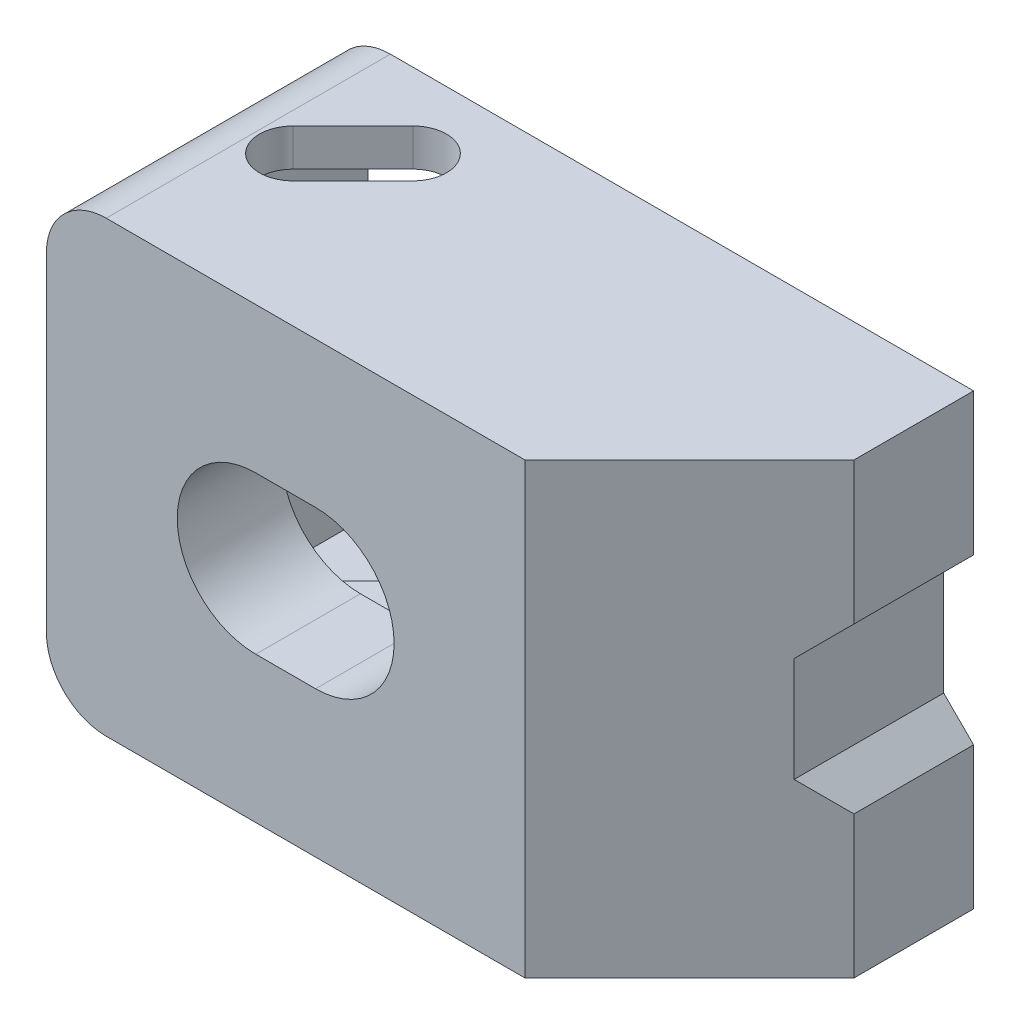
ISO-10303-21;
HEADER;
FILE_DESCRIPTION(('STEP AP214'),'2;1');
FILE_NAME('part.step','',(''),(''),'','','');
FILE_SCHEMA(('AUTOMOTIVE_DESIGN { 1 0 10303 214 1 1 1 1 }'));
ENDSEC;
DATA;
#1=APPLICATION_CONTEXT('core data for automotive mechanical design processes');
#2=APPLICATION_PROTOCOL_DEFINITION('international standard','automotive_design',2000,#1);
#3=PRODUCT_CONTEXT('',#1,'mechanical');
#4=PRODUCT('Part','Part','',(#3));
#5=PRODUCT_RELATED_PRODUCT_CATEGORY('part','',(#4));
#6=PRODUCT_DEFINITION_FORMATION('','',#4);
#7=PRODUCT_DEFINITION_CONTEXT('part definition',#1,'design');
#8=PRODUCT_DEFINITION('design','',#6,#7);
#9=PRODUCT_DEFINITION_SHAPE('','',#8);
#10=(LENGTH_UNIT() NAMED_UNIT(*) SI_UNIT(.MILLI.,.METRE.));
#11=(NAMED_UNIT(*) PLANE_ANGLE_UNIT() SI_UNIT($,.RADIAN.));
#12=(NAMED_UNIT(*) SI_UNIT($,.STERADIAN.) SOLID_ANGLE_UNIT());
#13=UNCERTAINTY_MEASURE_WITH_UNIT(LENGTH_MEASURE(1.E-05),#10,'distance_accuracy_value','');
#14=(GEOMETRIC_REPRESENTATION_CONTEXT(3) GLOBAL_UNCERTAINTY_ASSIGNED_CONTEXT((#13)) GLOBAL_UNIT_ASSIGNED_CONTEXT((#10,
#11,#12)) REPRESENTATION_CONTEXT('',''));
#15=CARTESIAN_POINT('',(0.,0.,0.));
#16=DIRECTION('',(0.,0.,1.));
#17=DIRECTION('',(1.,0.,0.));
#18=AXIS2_PLACEMENT_3D('',#15,#16,#17);
#19=CARTESIAN_POINT('',(25.,-34.2353840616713,0.));
#20=DIRECTION('',(1.,0.,0.));
#21=DIRECTION('',(0.,1.,0.));
#22=AXIS2_PLACEMENT_3D('',#19,#20,#21);
#23=PLANE('',#22);
#24=DIRECTION('',(0.,0.,1.));
#25=VECTOR('',#24,1.);
#26=CARTESIAN_POINT('',(25.,5.5,-4.99999999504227E-05));
#27=LINE('',#26,#25);
#28=CARTESIAN_POINT('',(25.,5.5,0.));
#29=VERTEX_POINT('',#28);
#30=CARTESIAN_POINT('',(25.,5.5,8.));
#31=VERTEX_POINT('',#30);
#32=EDGE_CURVE('E467',#29,#31,#27,.T.);
#33=ORIENTED_EDGE('',*,*,#32,.F.);
#34=DIRECTION('',(0.,1.,0.));
#35=VECTOR('',#34,1.);
#36=CARTESIAN_POINT('',(25.,-34.2353840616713,0.));
#37=LINE('',#36,#35);
#38=CARTESIAN_POINT('',(25.,15.,0.));
#39=VERTEX_POINT('',#38);
#40=EDGE_CURVE('E308',#29,#39,#37,.T.);
#41=ORIENTED_EDGE('',*,*,#40,.T.);
#42=DIRECTION('',(0.,0.,-1.));
#43=VECTOR('',#42,1.);
#44=CARTESIAN_POINT('',(25.,15.,0.));
#45=LINE('',#44,#43);
#46=CARTESIAN_POINT('',(25.,15.,8.));
#47=VERTEX_POINT('',#46);
#48=EDGE_CURVE('E297',#47,#39,#45,.T.);
#49=ORIENTED_EDGE('',*,*,#48,.F.);
#50=DIRECTION('',(0.,1.,0.));
#51=VECTOR('',#50,1.);
#52=CARTESIAN_POINT('',(25.,-15.,8.));
#53=LINE('',#52,#51);
#54=EDGE_CURVE('E293',#31,#47,#53,.T.);
#55=ORIENTED_EDGE('',*,*,#54,.F.);
#56=EDGE_LOOP('',(#33,#41,#49,#55));
#57=FACE_BOUND('',#56,.T.);
#58=ADVANCED_FACE('F14',(#57),#23,.T.);
#59=CARTESIAN_POINT('',(22.,-15.,32.));
#60=DIRECTION('',(0.,1.,0.));
#61=DIRECTION('',(-1.,0.,0.));
#62=AXIS2_PLACEMENT_3D('',#59,#60,#61);
#63=PLANE('',#62);
#64=DIRECTION('',(1.,0.,0.));
#65=VECTOR('',#64,1.);
#66=CARTESIAN_POINT('',(-7.,-15.,19.));
#67=LINE('',#66,#65);
#68=CARTESIAN_POINT('',(-14.,-15.,19.));
#69=VERTEX_POINT('',#68);
#70=CARTESIAN_POINT('',(14.,-15.,19.));
#71=VERTEX_POINT('',#70);
#72=EDGE_CURVE('E391',#69,#71,#67,.T.);
#73=ORIENTED_EDGE('',*,*,#72,.F.);
#74=DIRECTION('',(0.,0.,1.));
#75=VECTOR('',#74,1.);
#76=CARTESIAN_POINT('',(-14.,-15.,32.));
#77=LINE('',#76,#75);
#78=CARTESIAN_POINT('',(-14.,-15.,0.));
#79=VERTEX_POINT('',#78);
#80=EDGE_CURVE('E37',#69,#79,#77,.F.);
#81=ORIENTED_EDGE('',*,*,#80,.T.);
#82=DIRECTION('',(1.,0.,0.));
#83=VECTOR('',#82,1.);
#84=CARTESIAN_POINT('',(22.,-15.,0.));
#85=LINE('',#84,#83);
#86=CARTESIAN_POINT('',(25.,-15.,0.));
#87=VERTEX_POINT('',#86);
#88=EDGE_CURVE('E447',#79,#87,#85,.T.);
#89=ORIENTED_EDGE('',*,*,#88,.T.);
#90=DIRECTION('',(0.,0.,1.));
#91=VECTOR('',#90,1.);
#92=CARTESIAN_POINT('',(25.,-15.,0.));
#93=LINE('',#92,#91);
#94=CARTESIAN_POINT('',(25.,-15.,8.));
#95=VERTEX_POINT('',#94);
#96=EDGE_CURVE('E301',#87,#95,#93,.T.);
#97=ORIENTED_EDGE('',*,*,#96,.T.);
#98=DIRECTION('',(-0.707106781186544,0.,0.707106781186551));
#99=VECTOR('',#98,1.);
#100=CARTESIAN_POINT('',(25.,-15.,8.));
#101=LINE('',#100,#99);
#102=EDGE_CURVE('E287',#95,#71,#101,.T.);
#103=ORIENTED_EDGE('',*,*,#102,.T.);
#104=EDGE_LOOP('',(#73,#81,#89,#97,#103));
#105=FACE_BOUND('',#104,.T.);
#106=CARTESIAN_POINT('',(-11.5,-15.,9.));
#107=DIRECTION('',(0.,1.,0.));
#108=DIRECTION('',(0.,0.,-1.));
#109=AXIS2_PLACEMENT_3D('',#106,#107,#108);
#110=CIRCLE('',#109,2.25);
#111=CARTESIAN_POINT('',(-13.0909902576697,-15.,7.4090097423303));
#112=VERTEX_POINT('',#111);
#113=CARTESIAN_POINT('',(-9.90900974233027,-15.,10.5909902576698));
#114=VERTEX_POINT('',#113);
#115=EDGE_CURVE('E323',#112,#114,#110,.T.);
#116=ORIENTED_EDGE('',*,*,#115,.T.);
#117=DIRECTION('',(0.707106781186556,0.,-0.70710678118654));
#118=VECTOR('',#117,1.);
#119=CARTESIAN_POINT('',(-9.90900974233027,-15.,10.5909902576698));
#120=LINE('',#119,#118);
#121=CARTESIAN_POINT('',(-5.90900974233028,-15.,6.59099025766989));
#122=VERTEX_POINT('',#121);
#123=EDGE_CURVE('E310',#114,#122,#120,.T.);
#124=ORIENTED_EDGE('',*,*,#123,.T.);
#125=CARTESIAN_POINT('',(-7.5,-15.,5.00000000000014));
#126=DIRECTION('',(0.,1.,0.));
#127=DIRECTION('',(0.,0.,-1.));
#128=AXIS2_PLACEMENT_3D('',#125,#126,#127);
#129=CIRCLE('',#128,2.25);
#130=CARTESIAN_POINT('',(-9.0909902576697,-15.,3.40900974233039));
#131=VERTEX_POINT('',#130);
#132=EDGE_CURVE('E315',#122,#131,#129,.T.);
#133=ORIENTED_EDGE('',*,*,#132,.T.);
#134=DIRECTION('',(-0.707106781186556,0.,0.707106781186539));
#135=VECTOR('',#134,1.);
#136=CARTESIAN_POINT('',(-13.0909902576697,-15.,7.4090097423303));
#137=LINE('',#136,#135);
#138=EDGE_CURVE('E319',#131,#112,#137,.T.);
#139=ORIENTED_EDGE('',*,*,#138,.T.);
#140=EDGE_LOOP('',(#116,#124,#133,#139));
#141=FACE_BOUND('',#140,.T.);
#142=ADVANCED_FACE('F459',(#105,#141),#63,.F.);
#143=CARTESIAN_POINT('',(-15.5,-12.5,0.));
#144=DIRECTION('',(0.,1.,0.));
#145=DIRECTION('',(0.,0.,-1.));
#146=AXIS2_PLACEMENT_3D('',#143,#144,#145);
#147=PLANE('',#146);
#148=DIRECTION('',(-1.,0.,0.));
#149=VECTOR('',#148,1.);
#150=CARTESIAN_POINT('',(-15.5,-12.5,0.));
#151=LINE('',#150,#149);
#152=CARTESIAN_POINT('',(19.4705627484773,-12.5,0.));
#153=VERTEX_POINT('',#152);
#154=CARTESIAN_POINT('',(-15.5,-12.5,0.));
#155=VERTEX_POINT('',#154);
#156=EDGE_CURVE('E502',#153,#155,#151,.T.);
#157=ORIENTED_EDGE('',*,*,#156,.T.);
#158=DIRECTION('',(0.,0.,1.));
#159=VECTOR('',#158,1.);
#160=CARTESIAN_POINT('',(-15.5,-12.5,14.));
#161=LINE('',#160,#159);
#162=CARTESIAN_POINT('',(-15.5,-12.5,14.));
#163=VERTEX_POINT('',#162);
#164=EDGE_CURVE('E498',#155,#163,#161,.T.);
#165=ORIENTED_EDGE('',*,*,#164,.T.);
#166=DIRECTION('',(1.,0.,0.));
#167=VECTOR('',#166,1.);
#168=CARTESIAN_POINT('',(-11.5,-12.5,14.));
#169=LINE('',#168,#167);
#170=CARTESIAN_POINT('',(-11.5,-12.5,14.));
#171=VERTEX_POINT('',#170);
#172=EDGE_CURVE('E501',#163,#171,#169,.T.);
#173=ORIENTED_EDGE('',*,*,#172,.T.);
#174=DIRECTION('',(0.707106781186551,0.,-0.707106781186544));
#175=VECTOR('',#174,1.);
#176=CARTESIAN_POINT('',(-4.5,-12.5,7.));
#177=LINE('',#176,#175);
#178=CARTESIAN_POINT('',(-4.5,-12.5,7.));
#179=VERTEX_POINT('',#178);
#180=EDGE_CURVE('E521',#171,#179,#177,.T.);
#181=ORIENTED_EDGE('',*,*,#180,.T.);
#182=DIRECTION('',(1.,0.,0.));
#183=VECTOR('',#182,1.);
#184=CARTESIAN_POINT('',(12.4705627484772,-12.5,7.));
#185=LINE('',#184,#183);
#186=CARTESIAN_POINT('',(12.4705627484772,-12.5,7.));
#187=VERTEX_POINT('',#186);
#188=EDGE_CURVE('E524',#179,#187,#185,.T.);
#189=ORIENTED_EDGE('',*,*,#188,.T.);
#190=DIRECTION('',(0.707106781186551,0.,-0.707106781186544));
#191=VECTOR('',#190,1.);
#192=CARTESIAN_POINT('',(19.4705627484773,-12.5,0.));
#193=LINE('',#192,#191);
#194=EDGE_CURVE('E527',#187,#153,#193,.T.);
#195=ORIENTED_EDGE('',*,*,#194,.T.);
#196=EDGE_LOOP('',(#157,#165,#173,#181,#189,#195));
#197=FACE_BOUND('',#196,.T.);
#198=DIRECTION('',(-0.707106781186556,0.,0.70710678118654));
#199=VECTOR('',#198,1.);
#200=CARTESIAN_POINT('',(-7.40900974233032,-12.5,8.0909902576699));
#201=LINE('',#200,#199);
#202=CARTESIAN_POINT('',(-5.90900974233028,-12.5,6.59099025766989));
#203=VERTEX_POINT('',#202);
#204=CARTESIAN_POINT('',(-9.90900974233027,-12.5,10.5909902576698));
#205=VERTEX_POINT('',#204);
#206=EDGE_CURVE('E336',#203,#205,#201,.T.);
#207=ORIENTED_EDGE('',*,*,#206,.T.);
#208=CARTESIAN_POINT('',(-11.5,-12.5,9.));
#209=DIRECTION('',(0.,1.,0.));
#210=DIRECTION('',(0.,0.,-1.));
#211=AXIS2_PLACEMENT_3D('',#208,#209,#210);
#212=CIRCLE('',#211,2.25);
#213=CARTESIAN_POINT('',(-13.0909902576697,-12.5,7.4090097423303));
#214=VERTEX_POINT('',#213);
#215=EDGE_CURVE('E339',#205,#214,#212,.F.);
#216=ORIENTED_EDGE('',*,*,#215,.T.);
#217=DIRECTION('',(0.707106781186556,0.,-0.707106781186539));
#218=VECTOR('',#217,1.);
#219=CARTESIAN_POINT('',(-10.5909902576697,-12.5,4.9090097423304));
#220=LINE('',#219,#218);
#221=CARTESIAN_POINT('',(-9.0909902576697,-12.5,3.40900974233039));
#222=VERTEX_POINT('',#221);
#223=EDGE_CURVE('E322',#214,#222,#220,.T.);
#224=ORIENTED_EDGE('',*,*,#223,.T.);
#225=CARTESIAN_POINT('',(-7.5,-12.5,5.00000000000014));
#226=DIRECTION('',(0.,1.,0.));
#227=DIRECTION('',(0.,0.,-1.));
#228=AXIS2_PLACEMENT_3D('',#225,#226,#227);
#229=CIRCLE('',#228,2.25);
#230=EDGE_CURVE('E333',#222,#203,#229,.F.);
#231=ORIENTED_EDGE('',*,*,#230,.T.);
#232=EDGE_LOOP('',(#207,#216,#224,#231));
#233=FACE_BOUND('',#232,.T.);
#234=ADVANCED_FACE('F631',(#197,#233),#147,.T.);
#235=CARTESIAN_POINT('',(0.,0.,12.));
#236=DIRECTION('',(0.,0.,-1.));
#237=DIRECTION('',(1.,0.,0.));
#238=AXIS2_PLACEMENT_3D('',#235,#236,#237);
#239=CYLINDRICAL_SURFACE('',#238,7.25);
#240=DIRECTION('',(0.,0.,-1.));
#241=VECTOR('',#240,1.);
#242=CARTESIAN_POINT('',(6.20483682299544,3.75,12.));
#243=LINE('',#242,#241);
#244=CARTESIAN_POINT('',(6.20483682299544,3.75,12.));
#245=VERTEX_POINT('',#244);
#246=CARTESIAN_POINT('',(6.20483682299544,3.75,7.));
#247=VERTEX_POINT('',#246);
#248=EDGE_CURVE('E389',#245,#247,#243,.T.);
#249=ORIENTED_EDGE('',*,*,#248,.F.);
#250=CARTESIAN_POINT('',(0.,0.,12.));
#251=DIRECTION('',(0.,0.,-1.));
#252=DIRECTION('',(1.,0.,0.));
#253=AXIS2_PLACEMENT_3D('',#250,#251,#252);
#254=CIRCLE('',#253,7.25);
#255=CARTESIAN_POINT('',(0.,7.25,12.));
#256=VERTEX_POINT('',#255);
#257=EDGE_CURVE('E558',#256,#245,#254,.T.);
#258=ORIENTED_EDGE('',*,*,#257,.F.);
#259=DIRECTION('',(0.,0.,-1.));
#260=VECTOR('',#259,1.);
#261=CARTESIAN_POINT('',(0.,7.25,12.));
#262=LINE('',#261,#260);
#263=CARTESIAN_POINT('',(0.,7.25,7.));
#264=VERTEX_POINT('',#263);
#265=EDGE_CURVE('E564',#256,#264,#262,.T.);
#266=ORIENTED_EDGE('',*,*,#265,.T.);
#267=CARTESIAN_POINT('',(0.,0.,7.));
#268=DIRECTION('',(0.,0.,1.));
#269=DIRECTION('',(-1.,0.,0.));
#270=AXIS2_PLACEMENT_3D('',#267,#268,#269);
#271=CIRCLE('',#270,7.25);
#272=EDGE_CURVE('E493',#264,#247,#271,.F.);
#273=ORIENTED_EDGE('',*,*,#272,.T.);
#274=EDGE_LOOP('',(#249,#258,#266,#273));
#275=FACE_BOUND('',#274,.T.);
#276=ADVANCED_FACE('F699',(#275),#239,.F.);
#277=DIRECTION('',(0.,0.,-1.));
#278=VECTOR('',#277,1.);
#279=CARTESIAN_POINT('',(6.20483682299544,-3.75,12.));
#280=LINE('',#279,#278);
#281=CARTESIAN_POINT('',(6.20483682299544,-3.75,7.));
#282=VERTEX_POINT('',#281);
#283=CARTESIAN_POINT('',(6.20483682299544,-3.75,12.));
#284=VERTEX_POINT('',#283);
#285=EDGE_CURVE('E387',#282,#284,#280,.F.);
#286=ORIENTED_EDGE('',*,*,#285,.F.);
#287=CARTESIAN_POINT('',(0.,-7.25,7.));
#288=VERTEX_POINT('',#287);
#289=EDGE_CURVE('E492',#282,#288,#271,.F.);
#290=ORIENTED_EDGE('',*,*,#289,.T.);
#291=DIRECTION('',(0.,0.,-1.));
#292=VECTOR('',#291,1.);
#293=CARTESIAN_POINT('',(0.,-7.25,12.));
#294=LINE('',#293,#292);
#295=CARTESIAN_POINT('',(0.,-7.25,12.));
#296=VERTEX_POINT('',#295);
#297=EDGE_CURVE('E565',#296,#288,#294,.T.);
#298=ORIENTED_EDGE('',*,*,#297,.F.);
#299=EDGE_CURVE('E557',#284,#296,#254,.T.);
#300=ORIENTED_EDGE('',*,*,#299,.F.);
#301=EDGE_LOOP('',(#286,#290,#298,#300));
#302=FACE_BOUND('',#301,.T.);
#303=ADVANCED_FACE('F706',(#302),#239,.F.);
#304=CARTESIAN_POINT('',(12.4705627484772,-12.5,7.));
#305=DIRECTION('',(0.,0.,1.));
#306=DIRECTION('',(-1.,0.,0.));
#307=AXIS2_PLACEMENT_3D('',#304,#305,#306);
#308=PLANE('',#307);
#309=CARTESIAN_POINT('',(12.,0.,7.));
#310=DIRECTION('',(0.,0.,1.));
#311=DIRECTION('',(-1.,0.,0.));
#312=AXIS2_PLACEMENT_3D('',#309,#310,#311);
#313=CIRCLE('',#312,3.75);
#314=CARTESIAN_POINT('',(12.,3.75,7.));
#315=VERTEX_POINT('',#314);
#316=CARTESIAN_POINT('',(12.4705627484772,3.72035894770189,7.));
#317=VERTEX_POINT('',#316);
#318=EDGE_CURVE('E386',#315,#317,#313,.F.);
#319=ORIENTED_EDGE('',*,*,#318,.F.);
#320=DIRECTION('',(1.,0.,0.));
#321=VECTOR('',#320,1.);
#322=CARTESIAN_POINT('',(12.4705627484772,3.75,7.));
#323=LINE('',#322,#321);
#324=EDGE_CURVE('E426',#247,#315,#323,.T.);
#325=ORIENTED_EDGE('',*,*,#324,.F.);
#326=ORIENTED_EDGE('',*,*,#272,.F.);
#327=DIRECTION('',(1.,0.,0.));
#328=VECTOR('',#327,1.);
#329=CARTESIAN_POINT('',(-15.5,7.25,7.));
#330=LINE('',#329,#328);
#331=CARTESIAN_POINT('',(-4.5,7.25,7.));
#332=VERTEX_POINT('',#331);
#333=EDGE_CURVE('E547',#332,#264,#330,.T.);
#334=ORIENTED_EDGE('',*,*,#333,.F.);
#335=DIRECTION('',(0.,1.,0.));
#336=VECTOR('',#335,1.);
#337=CARTESIAN_POINT('',(-4.5,-12.5,7.));
#338=LINE('',#337,#336);
#339=CARTESIAN_POINT('',(-4.5,12.5,7.));
#340=VERTEX_POINT('',#339);
#341=EDGE_CURVE('E540',#332,#340,#338,.T.);
#342=ORIENTED_EDGE('',*,*,#341,.T.);
#343=DIRECTION('',(1.,0.,0.));
#344=VECTOR('',#343,1.);
#345=CARTESIAN_POINT('',(12.4705627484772,12.5,7.));
#346=LINE('',#345,#344);
#347=CARTESIAN_POINT('',(12.4705627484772,12.5,7.));
#348=VERTEX_POINT('',#347);
#349=EDGE_CURVE('E510',#340,#348,#346,.T.);
#350=ORIENTED_EDGE('',*,*,#349,.T.);
#351=DIRECTION('',(0.,1.,0.));
#352=VECTOR('',#351,1.);
#353=CARTESIAN_POINT('',(12.4705627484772,-12.5,7.));
#354=LINE('',#353,#352);
#355=EDGE_CURVE('E536',#317,#348,#354,.T.);
#356=ORIENTED_EDGE('',*,*,#355,.F.);
#357=EDGE_LOOP('',(#319,#325,#326,#334,#342,#350,#356));
#358=FACE_BOUND('',#357,.T.);
#359=ADVANCED_FACE('F703',(#358),#308,.F.);
#360=CARTESIAN_POINT('',(12.4705627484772,-3.7203589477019,7.));
#361=VERTEX_POINT('',#360);
#362=CARTESIAN_POINT('',(12.,-3.75,7.));
#363=VERTEX_POINT('',#362);
#364=EDGE_CURVE('E384',#361,#363,#313,.F.);
#365=ORIENTED_EDGE('',*,*,#364,.F.);
#366=EDGE_CURVE('E533',#187,#361,#354,.T.);
#367=ORIENTED_EDGE('',*,*,#366,.F.);
#368=ORIENTED_EDGE('',*,*,#188,.F.);
#369=CARTESIAN_POINT('',(-4.5,-7.25,7.));
#370=VERTEX_POINT('',#369);
#371=EDGE_CURVE('E537',#179,#370,#338,.T.);
#372=ORIENTED_EDGE('',*,*,#371,.T.);
#373=DIRECTION('',(-1.,0.,0.));
#374=VECTOR('',#373,1.);
#375=CARTESIAN_POINT('',(-15.5,-7.25,7.));
#376=LINE('',#375,#374);
#377=EDGE_CURVE('E532',#288,#370,#376,.T.);
#378=ORIENTED_EDGE('',*,*,#377,.F.);
#379=ORIENTED_EDGE('',*,*,#289,.F.);
#380=DIRECTION('',(-1.,0.,0.));
#381=VECTOR('',#380,1.);
#382=CARTESIAN_POINT('',(12.4705627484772,-3.75,7.));
#383=LINE('',#382,#381);
#384=EDGE_CURVE('E423',#363,#282,#383,.T.);
#385=ORIENTED_EDGE('',*,*,#384,.F.);
#386=EDGE_LOOP('',(#365,#367,#368,#372,#378,#379,#385));
#387=FACE_BOUND('',#386,.T.);
#388=ADVANCED_FACE('F702',(#387),#308,.F.);
#389=CARTESIAN_POINT('',(19.4705627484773,-12.5,0.));
#390=DIRECTION('',(0.707106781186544,0.,0.707106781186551));
#391=DIRECTION('',(-0.707106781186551,0.,0.707106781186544));
#392=AXIS2_PLACEMENT_3D('',#389,#390,#391);
#393=PLANE('',#392);
#394=CARTESIAN_POINT('',(12.,0.,7.47056274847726));
#395=DIRECTION('',(0.707106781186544,0.,0.707106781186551));
#396=DIRECTION('',(0.707106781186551,0.,-0.707106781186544));
#397=AXIS2_PLACEMENT_3D('',#394,#395,#396);
#398=ELLIPSE('',#397,5.30330085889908,3.75);
#399=EDGE_CURVE('E421',#317,#361,#398,.F.);
#400=ORIENTED_EDGE('',*,*,#399,.F.);
#401=ORIENTED_EDGE('',*,*,#355,.T.);
#402=DIRECTION('',(0.707106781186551,0.,-0.707106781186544));
#403=VECTOR('',#402,1.);
#404=CARTESIAN_POINT('',(19.4705627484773,12.5,0.));
#405=LINE('',#404,#403);
#406=CARTESIAN_POINT('',(19.4705627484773,12.5,0.));
#407=VERTEX_POINT('',#406);
#408=EDGE_CURVE('E505',#348,#407,#405,.T.);
#409=ORIENTED_EDGE('',*,*,#408,.T.);
#410=DIRECTION('',(0.,1.,0.));
#411=VECTOR('',#410,1.);
#412=CARTESIAN_POINT('',(19.4705627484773,-12.5,0.));
#413=LINE('',#412,#411);
#414=EDGE_CURVE('E530',#153,#407,#413,.T.);
#415=ORIENTED_EDGE('',*,*,#414,.F.);
#416=ORIENTED_EDGE('',*,*,#194,.F.);
#417=ORIENTED_EDGE('',*,*,#366,.T.);
#418=EDGE_LOOP('',(#400,#401,#409,#415,#416,#417));
#419=FACE_BOUND('',#418,.T.);
#420=ADVANCED_FACE('F621',(#419),#393,.F.);
#421=CARTESIAN_POINT('',(22.,15.,0.));
#422=DIRECTION('',(0.,0.,1.));
#423=DIRECTION('',(-1.,0.,0.));
#424=AXIS2_PLACEMENT_3D('',#421,#422,#423);
#425=PLANE('',#424);
#426=ORIENTED_EDGE('',*,*,#88,.F.);
#427=CARTESIAN_POINT('',(-14.,-11.,0.));
#428=DIRECTION('',(0.,0.,1.));
#429=DIRECTION('',(-1.,0.,0.));
#430=AXIS2_PLACEMENT_3D('',#427,#428,#429);
#431=CIRCLE('',#430,4.);
#432=CARTESIAN_POINT('',(-18.,-11.,0.));
#433=VERTEX_POINT('',#432);
#434=EDGE_CURVE('E22',#79,#433,#431,.F.);
#435=ORIENTED_EDGE('',*,*,#434,.T.);
#436=DIRECTION('',(0.,-1.,0.));
#437=VECTOR('',#436,1.);
#438=CARTESIAN_POINT('',(-18.,15.,0.));
#439=LINE('',#438,#437);
#440=CARTESIAN_POINT('',(-18.,11.,0.));
#441=VERTEX_POINT('',#440);
#442=EDGE_CURVE('E402',#441,#433,#439,.T.);
#443=ORIENTED_EDGE('',*,*,#442,.F.);
#444=CARTESIAN_POINT('',(-14.,11.,0.));
#445=DIRECTION('',(0.,0.,1.));
#446=DIRECTION('',(-1.,0.,0.));
#447=AXIS2_PLACEMENT_3D('',#444,#445,#446);
#448=CIRCLE('',#447,4.);
#449=CARTESIAN_POINT('',(-14.,15.,0.));
#450=VERTEX_POINT('',#449);
#451=EDGE_CURVE('E29',#441,#450,#448,.F.);
#452=ORIENTED_EDGE('',*,*,#451,.T.);
#453=DIRECTION('',(-1.,0.,0.));
#454=VECTOR('',#453,1.);
#455=CARTESIAN_POINT('',(22.,15.,0.));
#456=LINE('',#455,#454);
#457=EDGE_CURVE('E478',#39,#450,#456,.T.);
#458=ORIENTED_EDGE('',*,*,#457,.F.);
#459=ORIENTED_EDGE('',*,*,#40,.F.);
#460=DIRECTION('',(-0.707106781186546,-0.707106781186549,0.));
#461=VECTOR('',#460,1.);
#462=CARTESIAN_POINT('',(28.25,8.75,0.));
#463=LINE('',#462,#461);
#464=CARTESIAN_POINT('',(23.,3.5,0.));
#465=VERTEX_POINT('',#464);
#466=EDGE_CURVE('E269',#29,#465,#463,.T.);
#467=ORIENTED_EDGE('',*,*,#466,.T.);
#468=DIRECTION('',(0.,-1.,0.));
#469=VECTOR('',#468,1.);
#470=CARTESIAN_POINT('',(23.,15.,0.));
#471=LINE('',#470,#469);
#472=CARTESIAN_POINT('',(23.,-3.5,0.));
#473=VERTEX_POINT('',#472);
#474=EDGE_CURVE('E275',#465,#473,#471,.T.);
#475=ORIENTED_EDGE('',*,*,#474,.T.);
#476=DIRECTION('',(0.707106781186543,-0.707106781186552,0.));
#477=VECTOR('',#476,1.);
#478=CARTESIAN_POINT('',(13.25,6.2500000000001,0.));
#479=LINE('',#478,#477);
#480=CARTESIAN_POINT('',(25.,-5.5,0.));
#481=VERTEX_POINT('',#480);
#482=EDGE_CURVE('E259',#473,#481,#479,.T.);
#483=ORIENTED_EDGE('',*,*,#482,.T.);
#484=EDGE_CURVE('E305',#87,#481,#37,.T.);
#485=ORIENTED_EDGE('',*,*,#484,.F.);
#486=EDGE_LOOP('',(#426,#435,#443,#452,#458,#459,#467,#475,#483,#485));
#487=FACE_BOUND('',#486,.T.);
#488=ORIENTED_EDGE('',*,*,#156,.F.);
#489=ORIENTED_EDGE('',*,*,#414,.T.);
#490=DIRECTION('',(-1.,0.,0.));
#491=VECTOR('',#490,1.);
#492=CARTESIAN_POINT('',(-15.5,12.5,0.));
#493=LINE('',#492,#491);
#494=CARTESIAN_POINT('',(-15.5,12.5,0.));
#495=VERTEX_POINT('',#494);
#496=EDGE_CURVE('E414',#407,#495,#493,.T.);
#497=ORIENTED_EDGE('',*,*,#496,.T.);
#498=DIRECTION('',(0.,-1.,0.));
#499=VECTOR('',#498,1.);
#500=CARTESIAN_POINT('',(-15.5,15.,0.));
#501=LINE('',#500,#499);
#502=EDGE_CURVE('E399',#495,#155,#501,.T.);
#503=ORIENTED_EDGE('',*,*,#502,.T.);
#504=EDGE_LOOP('',(#488,#489,#497,#503));
#505=FACE_BOUND('',#504,.T.);
#506=ADVANCED_FACE('F282',(#487,#505),#425,.F.);
#507=CARTESIAN_POINT('',(-4.,0.,0.));
#508=DIRECTION('',(0.,0.,1.));
#509=DIRECTION('',(-1.,0.,0.));
#510=AXIS2_PLACEMENT_3D('',#507,#508,#509);
#511=CYLINDRICAL_SURFACE('',#510,5.25);
#512=CARTESIAN_POINT('',(-4.,0.,12.));
#513=DIRECTION('',(0.,0.,-1.));
#514=DIRECTION('',(1.,0.,0.));
#515=AXIS2_PLACEMENT_3D('',#512,#513,#514);
#516=CIRCLE('',#515,5.25);
#517=CARTESIAN_POINT('',(-4.,5.25,12.));
#518=VERTEX_POINT('',#517);
#519=CARTESIAN_POINT('',(-4.,-5.25,12.));
#520=VERTEX_POINT('',#519);
#521=EDGE_CURVE('E574',#518,#520,#516,.F.);
#522=ORIENTED_EDGE('',*,*,#521,.F.);
#523=DIRECTION('',(0.,0.,1.));
#524=VECTOR('',#523,1.);
#525=CARTESIAN_POINT('',(-4.,5.25,0.));
#526=LINE('',#525,#524);
#527=CARTESIAN_POINT('',(-4.,5.25,19.));
#528=VERTEX_POINT('',#527);
#529=EDGE_CURVE('E481',#518,#528,#526,.T.);
#530=ORIENTED_EDGE('',*,*,#529,.T.);
#531=CARTESIAN_POINT('',(-4.,0.,19.));
#532=DIRECTION('',(0.,0.,1.));
#533=DIRECTION('',(1.,0.,0.));
#534=AXIS2_PLACEMENT_3D('',#531,#532,#533);
#535=CIRCLE('',#534,5.25);
#536=CARTESIAN_POINT('',(-4.,-5.25,19.));
#537=VERTEX_POINT('',#536);
#538=EDGE_CURVE('E576',#528,#537,#535,.T.);
#539=ORIENTED_EDGE('',*,*,#538,.T.);
#540=DIRECTION('',(0.,0.,1.));
#541=VECTOR('',#540,1.);
#542=CARTESIAN_POINT('',(-4.,-5.25,0.));
#543=LINE('',#542,#541);
#544=EDGE_CURVE('E488',#520,#537,#543,.T.);
#545=ORIENTED_EDGE('',*,*,#544,.F.);
#546=EDGE_LOOP('',(#522,#530,#539,#545));
#547=FACE_BOUND('',#546,.T.);
#548=ADVANCED_FACE('F611',(#547),#511,.F.);
#549=CARTESIAN_POINT('',(-4.,5.25,0.));
#550=DIRECTION('',(0.,1.,0.));
#551=DIRECTION('',(0.,0.,-1.));
#552=AXIS2_PLACEMENT_3D('',#549,#550,#551);
#553=PLANE('',#552);
#554=DIRECTION('',(-1.,0.,0.));
#555=VECTOR('',#554,1.);
#556=CARTESIAN_POINT('',(-4.,5.25,12.));
#557=LINE('',#556,#555);
#558=CARTESIAN_POINT('',(0.,5.25,12.));
#559=VERTEX_POINT('',#558);
#560=EDGE_CURVE('E572',#559,#518,#557,.T.);
#561=ORIENTED_EDGE('',*,*,#560,.F.);
#562=DIRECTION('',(0.,0.,1.));
#563=VECTOR('',#562,1.);
#564=CARTESIAN_POINT('',(0.,5.25,0.));
#565=LINE('',#564,#563);
#566=CARTESIAN_POINT('',(0.,5.25,19.));
#567=VERTEX_POINT('',#566);
#568=EDGE_CURVE('E485',#559,#567,#565,.T.);
#569=ORIENTED_EDGE('',*,*,#568,.T.);
#570=DIRECTION('',(-1.,0.,0.));
#571=VECTOR('',#570,1.);
#572=CARTESIAN_POINT('',(-4.,5.25,19.));
#573=LINE('',#572,#571);
#574=EDGE_CURVE('E584',#567,#528,#573,.T.);
#575=ORIENTED_EDGE('',*,*,#574,.T.);
#576=ORIENTED_EDGE('',*,*,#529,.F.);
#577=EDGE_LOOP('',(#561,#569,#575,#576));
#578=FACE_BOUND('',#577,.T.);
#579=ADVANCED_FACE('F606',(#578),#553,.F.);
#580=CARTESIAN_POINT('',(0.,0.,0.));
#581=DIRECTION('',(0.,0.,1.));
#582=DIRECTION('',(-1.,0.,0.));
#583=AXIS2_PLACEMENT_3D('',#580,#581,#582);
#584=CYLINDRICAL_SURFACE('',#583,5.25);
#585=CARTESIAN_POINT('',(0.,0.,12.));
#586=DIRECTION('',(0.,0.,-1.));
#587=DIRECTION('',(1.,0.,0.));
#588=AXIS2_PLACEMENT_3D('',#585,#586,#587);
#589=CIRCLE('',#588,5.25);
#590=CARTESIAN_POINT('',(0.,-5.25,12.));
#591=VERTEX_POINT('',#590);
#592=EDGE_CURVE('E568',#591,#559,#589,.F.);
#593=ORIENTED_EDGE('',*,*,#592,.F.);
#594=DIRECTION('',(0.,0.,1.));
#595=VECTOR('',#594,1.);
#596=CARTESIAN_POINT('',(0.,-5.25,0.));
#597=LINE('',#596,#595);
#598=CARTESIAN_POINT('',(0.,-5.25,19.));
#599=VERTEX_POINT('',#598);
#600=EDGE_CURVE('E587',#591,#599,#597,.T.);
#601=ORIENTED_EDGE('',*,*,#600,.T.);
#602=CARTESIAN_POINT('',(0.,0.,19.));
#603=DIRECTION('',(0.,0.,1.));
#604=DIRECTION('',(-1.,0.,0.));
#605=AXIS2_PLACEMENT_3D('',#602,#603,#604);
#606=CIRCLE('',#605,5.25);
#607=EDGE_CURVE('E581',#599,#567,#606,.T.);
#608=ORIENTED_EDGE('',*,*,#607,.T.);
#609=ORIENTED_EDGE('',*,*,#568,.F.);
#610=EDGE_LOOP('',(#593,#601,#608,#609));
#611=FACE_BOUND('',#610,.T.);
#612=ADVANCED_FACE('F603',(#611),#584,.F.);
#613=CARTESIAN_POINT('',(-4.,-5.25,0.));
#614=DIRECTION('',(0.,-1.,0.));
#615=DIRECTION('',(0.,0.,1.));
#616=AXIS2_PLACEMENT_3D('',#613,#614,#615);
#617=PLANE('',#616);
#618=DIRECTION('',(1.,0.,0.));
#619=VECTOR('',#618,1.);
#620=CARTESIAN_POINT('',(-4.,-5.25,12.));
#621=LINE('',#620,#619);
#622=EDGE_CURVE('E483',#520,#591,#621,.T.);
#623=ORIENTED_EDGE('',*,*,#622,.F.);
#624=ORIENTED_EDGE('',*,*,#544,.T.);
#625=DIRECTION('',(1.,0.,0.));
#626=VECTOR('',#625,1.);
#627=CARTESIAN_POINT('',(-4.,-5.25,19.));
#628=LINE('',#627,#626);
#629=EDGE_CURVE('E578',#537,#599,#628,.T.);
#630=ORIENTED_EDGE('',*,*,#629,.T.);
#631=ORIENTED_EDGE('',*,*,#600,.F.);
#632=EDGE_LOOP('',(#623,#624,#630,#631));
#633=FACE_BOUND('',#632,.T.);
#634=ADVANCED_FACE('F596',(#633),#617,.F.);
#635=CARTESIAN_POINT('',(22.,15.,32.));
#636=DIRECTION('',(0.,-1.,0.));
#637=DIRECTION('',(1.,0.,0.));
#638=AXIS2_PLACEMENT_3D('',#635,#636,#637);
#639=PLANE('',#638);
#640=DIRECTION('',(0.707106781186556,0.,-0.70710678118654));
#641=VECTOR('',#640,1.);
#642=CARTESIAN_POINT('',(-9.90900974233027,15.,10.5909902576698));
#643=LINE('',#642,#641);
#644=CARTESIAN_POINT('',(-9.90900974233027,15.,10.5909902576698));
#645=VERTEX_POINT('',#644);
#646=CARTESIAN_POINT('',(-5.90900974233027,15.,6.59099025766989));
#647=VERTEX_POINT('',#646);
#648=EDGE_CURVE('E353',#645,#647,#643,.T.);
#649=ORIENTED_EDGE('',*,*,#648,.F.);
#650=CARTESIAN_POINT('',(-11.5,15.,9.));
#651=DIRECTION('',(0.,1.,0.));
#652=DIRECTION('',(0.,0.,-1.));
#653=AXIS2_PLACEMENT_3D('',#650,#651,#652);
#654=CIRCLE('',#653,2.25);
#655=CARTESIAN_POINT('',(-13.0909902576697,15.,7.4090097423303));
#656=VERTEX_POINT('',#655);
#657=EDGE_CURVE('E342',#656,#645,#654,.T.);
#658=ORIENTED_EDGE('',*,*,#657,.F.);
#659=DIRECTION('',(-0.707106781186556,0.,0.707106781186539));
#660=VECTOR('',#659,1.);
#661=CARTESIAN_POINT('',(-13.0909902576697,15.,7.4090097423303));
#662=LINE('',#661,#660);
#663=CARTESIAN_POINT('',(-9.0909902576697,15.,3.40900974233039));
#664=VERTEX_POINT('',#663);
#665=EDGE_CURVE('E359',#664,#656,#662,.T.);
#666=ORIENTED_EDGE('',*,*,#665,.F.);
#667=CARTESIAN_POINT('',(-7.5,15.,5.00000000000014));
#668=DIRECTION('',(0.,1.,0.));
#669=DIRECTION('',(0.,0.,-1.));
#670=AXIS2_PLACEMENT_3D('',#667,#668,#669);
#671=CIRCLE('',#670,2.25);
#672=EDGE_CURVE('E356',#647,#664,#671,.T.);
#673=ORIENTED_EDGE('',*,*,#672,.F.);
#674=EDGE_LOOP('',(#649,#658,#666,#673));
#675=FACE_BOUND('',#674,.T.);
#676=ORIENTED_EDGE('',*,*,#457,.T.);
#677=DIRECTION('',(0.,0.,-1.));
#678=VECTOR('',#677,1.);
#679=CARTESIAN_POINT('',(-14.,15.,32.));
#680=LINE('',#679,#678);
#681=CARTESIAN_POINT('',(-14.,15.,19.));
#682=VERTEX_POINT('',#681);
#683=EDGE_CURVE('E9',#450,#682,#680,.F.);
#684=ORIENTED_EDGE('',*,*,#683,.T.);
#685=DIRECTION('',(-1.,0.,0.));
#686=VECTOR('',#685,1.);
#687=CARTESIAN_POINT('',(-7.,15.,19.));
#688=LINE('',#687,#686);
#689=CARTESIAN_POINT('',(14.,15.,19.));
#690=VERTEX_POINT('',#689);
#691=EDGE_CURVE('E393',#690,#682,#688,.T.);
#692=ORIENTED_EDGE('',*,*,#691,.F.);
#693=DIRECTION('',(-0.707106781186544,0.,0.707106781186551));
#694=VECTOR('',#693,1.);
#695=CARTESIAN_POINT('',(25.,15.,8.));
#696=LINE('',#695,#694);
#697=EDGE_CURVE('E285',#47,#690,#696,.T.);
#698=ORIENTED_EDGE('',*,*,#697,.F.);
#699=ORIENTED_EDGE('',*,*,#48,.T.);
#700=EDGE_LOOP('',(#676,#684,#692,#698,#699));
#701=FACE_BOUND('',#700,.T.);
#702=ADVANCED_FACE('F16',(#675,#701),#639,.F.);
#703=CARTESIAN_POINT('',(0.,0.,19.));
#704=DIRECTION('',(0.,0.,1.));
#705=DIRECTION('',(-1.,0.,0.));
#706=AXIS2_PLACEMENT_3D('',#703,#704,#705);
#707=PLANE('',#706);
#708=DIRECTION('',(0.,1.,0.));
#709=VECTOR('',#708,1.);
#710=CARTESIAN_POINT('',(-18.,-15.001,19.));
#711=LINE('',#710,#709);
#712=CARTESIAN_POINT('',(-18.,-11.,19.));
#713=VERTEX_POINT('',#712);
#714=CARTESIAN_POINT('',(-18.,11.,19.));
#715=VERTEX_POINT('',#714);
#716=EDGE_CURVE('E396',#713,#715,#711,.T.);
#717=ORIENTED_EDGE('',*,*,#716,.F.);
#718=CARTESIAN_POINT('',(-14.,-11.,19.));
#719=DIRECTION('',(0.,0.,1.));
#720=DIRECTION('',(-1.,0.,0.));
#721=AXIS2_PLACEMENT_3D('',#718,#719,#720);
#722=CIRCLE('',#721,4.);
#723=EDGE_CURVE('E442',#713,#69,#722,.T.);
#724=ORIENTED_EDGE('',*,*,#723,.T.);
#725=ORIENTED_EDGE('',*,*,#72,.T.);
#726=DIRECTION('',(0.,1.,0.));
#727=VECTOR('',#726,1.);
#728=CARTESIAN_POINT('',(14.,-15.,19.));
#729=LINE('',#728,#727);
#730=EDGE_CURVE('E294',#71,#690,#729,.T.);
#731=ORIENTED_EDGE('',*,*,#730,.T.);
#732=ORIENTED_EDGE('',*,*,#691,.T.);
#733=CARTESIAN_POINT('',(-14.,11.,19.));
#734=DIRECTION('',(0.,0.,1.));
#735=DIRECTION('',(-1.,0.,0.));
#736=AXIS2_PLACEMENT_3D('',#733,#734,#735);
#737=CIRCLE('',#736,4.);
#738=EDGE_CURVE('E440',#682,#715,#737,.T.);
#739=ORIENTED_EDGE('',*,*,#738,.T.);
#740=EDGE_LOOP('',(#717,#724,#725,#731,#732,#739));
#741=FACE_BOUND('',#740,.T.);
#742=ORIENTED_EDGE('',*,*,#629,.F.);
#743=ORIENTED_EDGE('',*,*,#538,.F.);
#744=ORIENTED_EDGE('',*,*,#574,.F.);
#745=ORIENTED_EDGE('',*,*,#607,.F.);
#746=EDGE_LOOP('',(#742,#743,#744,#745));
#747=FACE_BOUND('',#746,.T.);
#748=ADVANCED_FACE('F456',(#741,#747),#707,.T.);
#749=CARTESIAN_POINT('',(0.,0.,12.));
#750=DIRECTION('',(0.,0.,-1.));
#751=DIRECTION('',(1.,0.,0.));
#752=AXIS2_PLACEMENT_3D('',#749,#750,#751);
#753=PLANE('',#752);
#754=ORIENTED_EDGE('',*,*,#592,.T.);
#755=ORIENTED_EDGE('',*,*,#560,.T.);
#756=ORIENTED_EDGE('',*,*,#521,.T.);
#757=ORIENTED_EDGE('',*,*,#622,.T.);
#758=EDGE_LOOP('',(#754,#755,#756,#757));
#759=FACE_BOUND('',#758,.T.);
#760=ORIENTED_EDGE('',*,*,#257,.T.);
#761=DIRECTION('',(-1.,0.,0.));
#762=VECTOR('',#761,1.);
#763=CARTESIAN_POINT('',(12.,3.75,12.));
#764=LINE('',#763,#762);
#765=CARTESIAN_POINT('',(12.,3.75,12.));
#766=VERTEX_POINT('',#765);
#767=EDGE_CURVE('E374',#766,#245,#764,.T.);
#768=ORIENTED_EDGE('',*,*,#767,.F.);
#769=CARTESIAN_POINT('',(12.,0.,12.));
#770=DIRECTION('',(0.,0.,1.));
#771=DIRECTION('',(-1.,0.,0.));
#772=AXIS2_PLACEMENT_3D('',#769,#770,#771);
#773=CIRCLE('',#772,3.75);
#774=CARTESIAN_POINT('',(12.,-3.75,12.));
#775=VERTEX_POINT('',#774);
#776=EDGE_CURVE('E371',#775,#766,#773,.T.);
#777=ORIENTED_EDGE('',*,*,#776,.F.);
#778=DIRECTION('',(1.,0.,0.));
#779=VECTOR('',#778,1.);
#780=CARTESIAN_POINT('',(12.,-3.75,12.));
#781=LINE('',#780,#779);
#782=EDGE_CURVE('E376',#284,#775,#781,.T.);
#783=ORIENTED_EDGE('',*,*,#782,.F.);
#784=ORIENTED_EDGE('',*,*,#299,.T.);
#785=DIRECTION('',(-1.,0.,0.));
#786=VECTOR('',#785,1.);
#787=CARTESIAN_POINT('',(-15.5,-7.25,12.));
#788=LINE('',#787,#786);
#789=CARTESIAN_POINT('',(-9.5,-7.25,12.));
#790=VERTEX_POINT('',#789);
#791=EDGE_CURVE('E561',#296,#790,#788,.T.);
#792=ORIENTED_EDGE('',*,*,#791,.T.);
#793=DIRECTION('',(0.,-1.,0.));
#794=VECTOR('',#793,1.);
#795=CARTESIAN_POINT('',(-9.5,0.,12.));
#796=LINE('',#795,#794);
#797=CARTESIAN_POINT('',(-9.5,7.25,12.));
#798=VERTEX_POINT('',#797);
#799=EDGE_CURVE('E550',#798,#790,#796,.T.);
#800=ORIENTED_EDGE('',*,*,#799,.F.);
#801=DIRECTION('',(1.,0.,0.));
#802=VECTOR('',#801,1.);
#803=CARTESIAN_POINT('',(-15.5,7.25,12.));
#804=LINE('',#803,#802);
#805=EDGE_CURVE('E555',#798,#256,#804,.T.);
#806=ORIENTED_EDGE('',*,*,#805,.T.);
#807=EDGE_LOOP('',(#760,#768,#777,#783,#784,#792,#800,#806));
#808=FACE_BOUND('',#807,.T.);
#809=ADVANCED_FACE('F609',(#759,#808),#753,.T.);
#810=CARTESIAN_POINT('',(-15.5,7.25,12.));
#811=DIRECTION('',(0.,1.,0.));
#812=DIRECTION('',(0.,0.,-1.));
#813=AXIS2_PLACEMENT_3D('',#810,#811,#812);
#814=PLANE('',#813);
#815=DIRECTION('',(0.707106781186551,0.,-0.707106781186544));
#816=VECTOR('',#815,1.);
#817=CARTESIAN_POINT('',(-12.5,7.25,15.));
#818=LINE('',#817,#816);
#819=EDGE_CURVE('E552',#798,#332,#818,.T.);
#820=ORIENTED_EDGE('',*,*,#819,.T.);
#821=ORIENTED_EDGE('',*,*,#333,.T.);
#822=ORIENTED_EDGE('',*,*,#265,.F.);
#823=ORIENTED_EDGE('',*,*,#805,.F.);
#824=EDGE_LOOP('',(#820,#821,#822,#823));
#825=FACE_BOUND('',#824,.T.);
#826=ADVANCED_FACE('F718',(#825),#814,.F.);
#827=CARTESIAN_POINT('',(-15.5,-7.25,12.));
#828=DIRECTION('',(0.,-1.,0.));
#829=DIRECTION('',(1.,0.,0.));
#830=AXIS2_PLACEMENT_3D('',#827,#828,#829);
#831=PLANE('',#830);
#832=ORIENTED_EDGE('',*,*,#297,.T.);
#833=ORIENTED_EDGE('',*,*,#377,.T.);
#834=DIRECTION('',(-0.707106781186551,0.,0.707106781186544));
#835=VECTOR('',#834,1.);
#836=CARTESIAN_POINT('',(-12.5,-7.25,15.));
#837=LINE('',#836,#835);
#838=EDGE_CURVE('E424',#370,#790,#837,.T.);
#839=ORIENTED_EDGE('',*,*,#838,.T.);
#840=ORIENTED_EDGE('',*,*,#791,.F.);
#841=EDGE_LOOP('',(#832,#833,#839,#840));
#842=FACE_BOUND('',#841,.T.);
#843=ADVANCED_FACE('F711',(#842),#831,.F.);
#844=CARTESIAN_POINT('',(-4.5,-12.5,7.));
#845=DIRECTION('',(0.707106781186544,0.,0.707106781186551));
#846=DIRECTION('',(-0.707106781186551,0.,0.707106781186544));
#847=AXIS2_PLACEMENT_3D('',#844,#845,#846);
#848=PLANE('',#847);
#849=ORIENTED_EDGE('',*,*,#799,.T.);
#850=ORIENTED_EDGE('',*,*,#838,.F.);
#851=ORIENTED_EDGE('',*,*,#371,.F.);
#852=ORIENTED_EDGE('',*,*,#180,.F.);
#853=DIRECTION('',(0.,1.,0.));
#854=VECTOR('',#853,1.);
#855=CARTESIAN_POINT('',(-11.5,-12.5,14.));
#856=LINE('',#855,#854);
#857=CARTESIAN_POINT('',(-11.5,12.5,14.));
#858=VERTEX_POINT('',#857);
#859=EDGE_CURVE('E541',#171,#858,#856,.T.);
#860=ORIENTED_EDGE('',*,*,#859,.T.);
#861=DIRECTION('',(0.707106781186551,0.,-0.707106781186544));
#862=VECTOR('',#861,1.);
#863=CARTESIAN_POINT('',(-4.5,12.5,7.));
#864=LINE('',#863,#862);
#865=EDGE_CURVE('E516',#858,#340,#864,.T.);
#866=ORIENTED_EDGE('',*,*,#865,.T.);
#867=ORIENTED_EDGE('',*,*,#341,.F.);
#868=ORIENTED_EDGE('',*,*,#819,.F.);
#869=EDGE_LOOP('',(#849,#850,#851,#852,#860,#866,#867,#868));
#870=FACE_BOUND('',#869,.T.);
#871=ADVANCED_FACE('F708',(#870),#848,.F.);
#872=CARTESIAN_POINT('',(-11.5,-12.5,14.));
#873=DIRECTION('',(0.,0.,1.));
#874=DIRECTION('',(-1.,0.,0.));
#875=AXIS2_PLACEMENT_3D('',#872,#873,#874);
#876=PLANE('',#875);
#877=DIRECTION('',(1.,0.,0.));
#878=VECTOR('',#877,1.);
#879=CARTESIAN_POINT('',(-11.5,12.5,14.));
#880=LINE('',#879,#878);
#881=CARTESIAN_POINT('',(-15.5,12.5,14.));
#882=VERTEX_POINT('',#881);
#883=EDGE_CURVE('E408',#882,#858,#880,.T.);
#884=ORIENTED_EDGE('',*,*,#883,.T.);
#885=ORIENTED_EDGE('',*,*,#859,.F.);
#886=ORIENTED_EDGE('',*,*,#172,.F.);
#887=DIRECTION('',(0.,1.,0.));
#888=VECTOR('',#887,1.);
#889=CARTESIAN_POINT('',(-15.5,-12.5,14.));
#890=LINE('',#889,#888);
#891=EDGE_CURVE('E529',#163,#882,#890,.T.);
#892=ORIENTED_EDGE('',*,*,#891,.T.);
#893=EDGE_LOOP('',(#884,#885,#886,#892));
#894=FACE_BOUND('',#893,.T.);
#895=ADVANCED_FACE('F695',(#894),#876,.F.);
#896=CARTESIAN_POINT('',(-15.5,12.5,0.));
#897=DIRECTION('',(0.,1.,0.));
#898=DIRECTION('',(0.,0.,-1.));
#899=AXIS2_PLACEMENT_3D('',#896,#897,#898);
#900=PLANE('',#899);
#901=DIRECTION('',(0.707106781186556,0.,-0.707106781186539));
#902=VECTOR('',#901,1.);
#903=CARTESIAN_POINT('',(-13.0909902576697,12.5,7.4090097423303));
#904=LINE('',#903,#902);
#905=CARTESIAN_POINT('',(-13.0909902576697,12.5,7.4090097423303));
#906=VERTEX_POINT('',#905);
#907=CARTESIAN_POINT('',(-9.0909902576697,12.5,3.40900974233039));
#908=VERTEX_POINT('',#907);
#909=EDGE_CURVE('E346',#906,#908,#904,.T.);
#910=ORIENTED_EDGE('',*,*,#909,.F.);
#911=CARTESIAN_POINT('',(-11.5,12.5,9.));
#912=DIRECTION('',(0.,1.,0.));
#913=DIRECTION('',(0.,0.,-1.));
#914=AXIS2_PLACEMENT_3D('',#911,#912,#913);
#915=CIRCLE('',#914,2.25);
#916=CARTESIAN_POINT('',(-9.90900974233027,12.5,10.5909902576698));
#917=VERTEX_POINT('',#916);
#918=EDGE_CURVE('E349',#917,#906,#915,.F.);
#919=ORIENTED_EDGE('',*,*,#918,.F.);
#920=DIRECTION('',(-0.707106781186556,0.,0.70710678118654));
#921=VECTOR('',#920,1.);
#922=CARTESIAN_POINT('',(-9.90900974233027,12.5,10.5909902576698));
#923=LINE('',#922,#921);
#924=CARTESIAN_POINT('',(-5.90900974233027,12.5,6.59099025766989));
#925=VERTEX_POINT('',#924);
#926=EDGE_CURVE('E351',#925,#917,#923,.T.);
#927=ORIENTED_EDGE('',*,*,#926,.F.);
#928=CARTESIAN_POINT('',(-7.5,12.5,5.00000000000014));
#929=DIRECTION('',(0.,1.,0.));
#930=DIRECTION('',(0.,0.,-1.));
#931=AXIS2_PLACEMENT_3D('',#928,#929,#930);
#932=CIRCLE('',#931,2.25);
#933=EDGE_CURVE('E343',#908,#925,#932,.F.);
#934=ORIENTED_EDGE('',*,*,#933,.F.);
#935=EDGE_LOOP('',(#910,#919,#927,#934));
#936=FACE_BOUND('',#935,.T.);
#937=ORIENTED_EDGE('',*,*,#496,.F.);
#938=ORIENTED_EDGE('',*,*,#408,.F.);
#939=ORIENTED_EDGE('',*,*,#349,.F.);
#940=ORIENTED_EDGE('',*,*,#865,.F.);
#941=ORIENTED_EDGE('',*,*,#883,.F.);
#942=DIRECTION('',(0.,0.,1.));
#943=VECTOR('',#942,1.);
#944=CARTESIAN_POINT('',(-15.5,12.5,14.));
#945=LINE('',#944,#943);
#946=EDGE_CURVE('E411',#495,#882,#945,.T.);
#947=ORIENTED_EDGE('',*,*,#946,.F.);
#948=EDGE_LOOP('',(#937,#938,#939,#940,#941,#947));
#949=FACE_BOUND('',#948,.T.);
#950=ADVANCED_FACE('F689',(#936,#949),#900,.F.);
#951=CARTESIAN_POINT('',(-15.5,-15.,32.));
#952=DIRECTION('',(1.,0.,0.));
#953=DIRECTION('',(0.,0.,1.));
#954=AXIS2_PLACEMENT_3D('',#951,#952,#953);
#955=PLANE('',#954);
#956=ORIENTED_EDGE('',*,*,#164,.F.);
#957=ORIENTED_EDGE('',*,*,#502,.F.);
#958=ORIENTED_EDGE('',*,*,#946,.T.);
#959=ORIENTED_EDGE('',*,*,#891,.F.);
#960=EDGE_LOOP('',(#956,#957,#958,#959));
#961=FACE_BOUND('',#960,.T.);
#962=ADVANCED_FACE('F686',(#961),#955,.T.);
#963=CARTESIAN_POINT('',(-18.,-15.,32.));
#964=DIRECTION('',(1.,0.,0.));
#965=DIRECTION('',(0.,0.,1.));
#966=AXIS2_PLACEMENT_3D('',#963,#964,#965);
#967=PLANE('',#966);
#968=ORIENTED_EDGE('',*,*,#442,.T.);
#969=DIRECTION('',(0.,0.,1.));
#970=VECTOR('',#969,1.);
#971=CARTESIAN_POINT('',(-18.,-11.,32.));
#972=LINE('',#971,#970);
#973=EDGE_CURVE('E437',#433,#713,#972,.T.);
#974=ORIENTED_EDGE('',*,*,#973,.T.);
#975=ORIENTED_EDGE('',*,*,#716,.T.);
#976=DIRECTION('',(0.,0.,-1.));
#977=VECTOR('',#976,1.);
#978=CARTESIAN_POINT('',(-18.,11.,32.));
#979=LINE('',#978,#977);
#980=EDGE_CURVE('E434',#715,#441,#979,.T.);
#981=ORIENTED_EDGE('',*,*,#980,.T.);
#982=EDGE_LOOP('',(#968,#974,#975,#981));
#983=FACE_BOUND('',#982,.T.);
#984=ADVANCED_FACE('F451',(#983),#967,.F.);
#985=CARTESIAN_POINT('',(12.,3.75,12.));
#986=DIRECTION('',(0.,-1.,0.));
#987=DIRECTION('',(0.,0.,1.));
#988=AXIS2_PLACEMENT_3D('',#985,#986,#987);
#989=PLANE('',#988);
#990=ORIENTED_EDGE('',*,*,#248,.T.);
#991=ORIENTED_EDGE('',*,*,#324,.T.);
#992=DIRECTION('',(0.,0.,-1.));
#993=VECTOR('',#992,1.);
#994=CARTESIAN_POINT('',(12.,3.75,12.));
#995=LINE('',#994,#993);
#996=EDGE_CURVE('E381',#766,#315,#995,.T.);
#997=ORIENTED_EDGE('',*,*,#996,.F.);
#998=ORIENTED_EDGE('',*,*,#767,.T.);
#999=EDGE_LOOP('',(#990,#991,#997,#998));
#1000=FACE_BOUND('',#999,.T.);
#1001=ADVANCED_FACE('F678',(#1000),#989,.T.);
#1002=CARTESIAN_POINT('',(12.,-3.75,12.));
#1003=DIRECTION('',(0.,1.,0.));
#1004=DIRECTION('',(0.,0.,-1.));
#1005=AXIS2_PLACEMENT_3D('',#1002,#1003,#1004);
#1006=PLANE('',#1005);
#1007=ORIENTED_EDGE('',*,*,#285,.T.);
#1008=ORIENTED_EDGE('',*,*,#782,.T.);
#1009=DIRECTION('',(0.,0.,-1.));
#1010=VECTOR('',#1009,1.);
#1011=CARTESIAN_POINT('',(12.,-3.75,12.));
#1012=LINE('',#1011,#1010);
#1013=EDGE_CURVE('E378',#775,#363,#1012,.T.);
#1014=ORIENTED_EDGE('',*,*,#1013,.T.);
#1015=ORIENTED_EDGE('',*,*,#384,.T.);
#1016=EDGE_LOOP('',(#1007,#1008,#1014,#1015));
#1017=FACE_BOUND('',#1016,.T.);
#1018=ADVANCED_FACE('F675',(#1017),#1006,.T.);
#1019=CARTESIAN_POINT('',(12.,0.,12.));
#1020=DIRECTION('',(0.,0.,-1.));
#1021=DIRECTION('',(1.,0.,0.));
#1022=AXIS2_PLACEMENT_3D('',#1019,#1020,#1021);
#1023=CYLINDRICAL_SURFACE('',#1022,3.75);
#1024=ORIENTED_EDGE('',*,*,#318,.T.);
#1025=ORIENTED_EDGE('',*,*,#399,.T.);
#1026=ORIENTED_EDGE('',*,*,#364,.T.);
#1027=ORIENTED_EDGE('',*,*,#1013,.F.);
#1028=ORIENTED_EDGE('',*,*,#776,.T.);
#1029=ORIENTED_EDGE('',*,*,#996,.T.);
#1030=EDGE_LOOP('',(#1024,#1025,#1026,#1027,#1028,#1029));
#1031=FACE_BOUND('',#1030,.T.);
#1032=ADVANCED_FACE('F673',(#1031),#1023,.F.);
#1033=CARTESIAN_POINT('',(-11.5,0.479184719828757,9.));
#1034=DIRECTION('',(0.,1.,0.));
#1035=DIRECTION('',(0.,0.,-1.));
#1036=AXIS2_PLACEMENT_3D('',#1033,#1034,#1035);
#1037=CYLINDRICAL_SURFACE('',#1036,2.25);
#1038=ORIENTED_EDGE('',*,*,#918,.T.);
#1039=DIRECTION('',(0.,1.,0.));
#1040=VECTOR('',#1039,1.);
#1041=CARTESIAN_POINT('',(-13.0909902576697,0.479184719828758,7.4090097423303));
#1042=LINE('',#1041,#1040);
#1043=EDGE_CURVE('E347',#906,#656,#1042,.T.);
#1044=ORIENTED_EDGE('',*,*,#1043,.T.);
#1045=ORIENTED_EDGE('',*,*,#657,.T.);
#1046=DIRECTION('',(0.,1.,0.));
#1047=VECTOR('',#1046,1.);
#1048=CARTESIAN_POINT('',(-9.90900974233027,0.479184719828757,10.5909902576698));
#1049=LINE('',#1048,#1047);
#1050=EDGE_CURVE('E362',#917,#645,#1049,.T.);
#1051=ORIENTED_EDGE('',*,*,#1050,.F.);
#1052=EDGE_LOOP('',(#1038,#1044,#1045,#1051));
#1053=FACE_BOUND('',#1052,.T.);
#1054=ADVANCED_FACE('F663',(#1053),#1037,.F.);
#1055=CARTESIAN_POINT('',(-13.0909902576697,0.479184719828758,7.4090097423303));
#1056=DIRECTION('',(-0.707106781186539,0.,-0.707106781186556));
#1057=DIRECTION('',(0.707106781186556,0.,-0.707106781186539));
#1058=AXIS2_PLACEMENT_3D('',#1055,#1056,#1057);
#1059=PLANE('',#1058);
#1060=ORIENTED_EDGE('',*,*,#909,.T.);
#1061=DIRECTION('',(0.,1.,0.));
#1062=VECTOR('',#1061,1.);
#1063=CARTESIAN_POINT('',(-9.0909902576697,0.479184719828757,3.40900974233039));
#1064=LINE('',#1063,#1062);
#1065=EDGE_CURVE('E364',#908,#664,#1064,.T.);
#1066=ORIENTED_EDGE('',*,*,#1065,.T.);
#1067=ORIENTED_EDGE('',*,*,#665,.T.);
#1068=ORIENTED_EDGE('',*,*,#1043,.F.);
#1069=EDGE_LOOP('',(#1060,#1066,#1067,#1068));
#1070=FACE_BOUND('',#1069,.T.);
#1071=ADVANCED_FACE('F659',(#1070),#1059,.F.);
#1072=CARTESIAN_POINT('',(-7.5,0.479184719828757,5.00000000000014));
#1073=DIRECTION('',(0.,1.,0.));
#1074=DIRECTION('',(0.,0.,-1.));
#1075=AXIS2_PLACEMENT_3D('',#1072,#1073,#1074);
#1076=CYLINDRICAL_SURFACE('',#1075,2.25);
#1077=ORIENTED_EDGE('',*,*,#933,.T.);
#1078=DIRECTION('',(0.,1.,0.));
#1079=VECTOR('',#1078,1.);
#1080=CARTESIAN_POINT('',(-5.90900974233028,0.479184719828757,6.59099025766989));
#1081=LINE('',#1080,#1079);
#1082=EDGE_CURVE('E366',#925,#647,#1081,.T.);
#1083=ORIENTED_EDGE('',*,*,#1082,.T.);
#1084=ORIENTED_EDGE('',*,*,#672,.T.);
#1085=ORIENTED_EDGE('',*,*,#1065,.F.);
#1086=EDGE_LOOP('',(#1077,#1083,#1084,#1085));
#1087=FACE_BOUND('',#1086,.T.);
#1088=ADVANCED_FACE('F662',(#1087),#1076,.F.);
#1089=CARTESIAN_POINT('',(-9.90900974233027,0.479184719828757,10.5909902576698));
#1090=DIRECTION('',(0.70710678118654,0.,0.707106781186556));
#1091=DIRECTION('',(-0.707106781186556,0.,0.70710678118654));
#1092=AXIS2_PLACEMENT_3D('',#1089,#1090,#1091);
#1093=PLANE('',#1092);
#1094=ORIENTED_EDGE('',*,*,#926,.T.);
#1095=ORIENTED_EDGE('',*,*,#1050,.T.);
#1096=ORIENTED_EDGE('',*,*,#648,.T.);
#1097=ORIENTED_EDGE('',*,*,#1082,.F.);
#1098=EDGE_LOOP('',(#1094,#1095,#1096,#1097));
#1099=FACE_BOUND('',#1098,.T.);
#1100=ADVANCED_FACE('F657',(#1099),#1093,.F.);
#1101=CARTESIAN_POINT('',(-11.5,24.5208152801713,9.));
#1102=DIRECTION('',(0.,-1.,0.));
#1103=DIRECTION('',(0.,0.,1.));
#1104=AXIS2_PLACEMENT_3D('',#1101,#1102,#1103);
#1105=CYLINDRICAL_SURFACE('',#1104,2.25);
#1106=DIRECTION('',(0.,-1.,0.));
#1107=VECTOR('',#1106,1.);
#1108=CARTESIAN_POINT('',(-9.90900974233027,24.5208152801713,10.5909902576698));
#1109=LINE('',#1108,#1107);
#1110=EDGE_CURVE('E314',#205,#114,#1109,.T.);
#1111=ORIENTED_EDGE('',*,*,#1110,.T.);
#1112=ORIENTED_EDGE('',*,*,#115,.F.);
#1113=DIRECTION('',(0.,-1.,0.));
#1114=VECTOR('',#1113,1.);
#1115=CARTESIAN_POINT('',(-13.0909902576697,24.5208152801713,7.4090097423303));
#1116=LINE('',#1115,#1114);
#1117=EDGE_CURVE('E304',#214,#112,#1116,.T.);
#1118=ORIENTED_EDGE('',*,*,#1117,.F.);
#1119=ORIENTED_EDGE('',*,*,#215,.F.);
#1120=EDGE_LOOP('',(#1111,#1112,#1118,#1119));
#1121=FACE_BOUND('',#1120,.T.);
#1122=ADVANCED_FACE('F653',(#1121),#1105,.F.);
#1123=CARTESIAN_POINT('',(-9.90900974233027,24.5208152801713,10.5909902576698));
#1124=DIRECTION('',(-0.70710678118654,0.,-0.707106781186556));
#1125=DIRECTION('',(0.707106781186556,0.,-0.70710678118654));
#1126=AXIS2_PLACEMENT_3D('',#1123,#1124,#1125);
#1127=PLANE('',#1126);
#1128=DIRECTION('',(0.,-1.,0.));
#1129=VECTOR('',#1128,1.);
#1130=CARTESIAN_POINT('',(-5.90900974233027,24.5208152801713,6.59099025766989));
#1131=LINE('',#1130,#1129);
#1132=EDGE_CURVE('E313',#203,#122,#1131,.T.);
#1133=ORIENTED_EDGE('',*,*,#1132,.T.);
#1134=ORIENTED_EDGE('',*,*,#123,.F.);
#1135=ORIENTED_EDGE('',*,*,#1110,.F.);
#1136=ORIENTED_EDGE('',*,*,#206,.F.);
#1137=EDGE_LOOP('',(#1133,#1134,#1135,#1136));
#1138=FACE_BOUND('',#1137,.T.);
#1139=ADVANCED_FACE('F647',(#1138),#1127,.T.);
#1140=CARTESIAN_POINT('',(-7.5,24.5208152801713,5.00000000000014));
#1141=DIRECTION('',(0.,-1.,0.));
#1142=DIRECTION('',(0.,0.,1.));
#1143=AXIS2_PLACEMENT_3D('',#1140,#1141,#1142);
#1144=CYLINDRICAL_SURFACE('',#1143,2.25);
#1145=DIRECTION('',(0.,-1.,0.));
#1146=VECTOR('',#1145,1.);
#1147=CARTESIAN_POINT('',(-9.0909902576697,24.5208152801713,3.40900974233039));
#1148=LINE('',#1147,#1146);
#1149=EDGE_CURVE('E318',#222,#131,#1148,.T.);
#1150=ORIENTED_EDGE('',*,*,#1149,.T.);
#1151=ORIENTED_EDGE('',*,*,#132,.F.);
#1152=ORIENTED_EDGE('',*,*,#1132,.F.);
#1153=ORIENTED_EDGE('',*,*,#230,.F.);
#1154=EDGE_LOOP('',(#1150,#1151,#1152,#1153));
#1155=FACE_BOUND('',#1154,.T.);
#1156=ADVANCED_FACE('F641',(#1155),#1144,.F.);
#1157=CARTESIAN_POINT('',(-13.0909902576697,24.5208152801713,7.4090097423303));
#1158=DIRECTION('',(0.707106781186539,0.,0.707106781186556));
#1159=DIRECTION('',(-0.707106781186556,0.,0.707106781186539));
#1160=AXIS2_PLACEMENT_3D('',#1157,#1158,#1159);
#1161=PLANE('',#1160);
#1162=ORIENTED_EDGE('',*,*,#1117,.T.);
#1163=ORIENTED_EDGE('',*,*,#138,.F.);
#1164=ORIENTED_EDGE('',*,*,#1149,.F.);
#1165=ORIENTED_EDGE('',*,*,#223,.F.);
#1166=EDGE_LOOP('',(#1162,#1163,#1164,#1165));
#1167=FACE_BOUND('',#1166,.T.);
#1168=ADVANCED_FACE('F635',(#1167),#1161,.T.);
#1169=DIRECTION('',(0.,0.,1.));
#1170=VECTOR('',#1169,1.);
#1171=CARTESIAN_POINT('',(25.,-5.5,-4.99999999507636E-05));
#1172=LINE('',#1171,#1170);
#1173=CARTESIAN_POINT('',(25.,-5.5,8.));
#1174=VERTEX_POINT('',#1173);
#1175=EDGE_CURVE('E265',#481,#1174,#1172,.T.);
#1176=ORIENTED_EDGE('',*,*,#1175,.T.);
#1177=EDGE_CURVE('E298',#95,#1174,#53,.T.);
#1178=ORIENTED_EDGE('',*,*,#1177,.F.);
#1179=ORIENTED_EDGE('',*,*,#96,.F.);
#1180=ORIENTED_EDGE('',*,*,#484,.T.);
#1181=EDGE_LOOP('',(#1176,#1178,#1179,#1180));
#1182=FACE_BOUND('',#1181,.T.);
#1183=ADVANCED_FACE('F466',(#1182),#23,.T.);
#1184=CARTESIAN_POINT('',(25.,-15.,8.));
#1185=DIRECTION('',(-0.707106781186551,0.,-0.707106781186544));
#1186=DIRECTION('',(0.707106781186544,0.,-0.707106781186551));
#1187=AXIS2_PLACEMENT_3D('',#1184,#1185,#1186);
#1188=PLANE('',#1187);
#1189=DIRECTION('',(0.,1.,0.));
#1190=VECTOR('',#1189,1.);
#1191=CARTESIAN_POINT('',(23.,-15.,10.));
#1192=LINE('',#1191,#1190);
#1193=CARTESIAN_POINT('',(23.,-3.5,10.));
#1194=VERTEX_POINT('',#1193);
#1195=CARTESIAN_POINT('',(23.,3.5,10.));
#1196=VERTEX_POINT('',#1195);
#1197=EDGE_CURVE('E278',#1194,#1196,#1192,.T.);
#1198=ORIENTED_EDGE('',*,*,#1197,.T.);
#1199=DIRECTION('',(0.577350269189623,0.577350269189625,-0.577350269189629));
#1200=VECTOR('',#1199,1.);
#1201=CARTESIAN_POINT('',(18.1666666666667,-1.33333333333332,14.8333333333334));
#1202=LINE('',#1201,#1200);
#1203=EDGE_CURVE('E431',#1196,#31,#1202,.T.);
#1204=ORIENTED_EDGE('',*,*,#1203,.T.);
#1205=ORIENTED_EDGE('',*,*,#54,.T.);
#1206=ORIENTED_EDGE('',*,*,#697,.T.);
#1207=ORIENTED_EDGE('',*,*,#730,.F.);
#1208=ORIENTED_EDGE('',*,*,#102,.F.);
#1209=ORIENTED_EDGE('',*,*,#1177,.T.);
#1210=DIRECTION('',(-0.577350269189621,0.577350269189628,0.577350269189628));
#1211=VECTOR('',#1210,1.);
#1212=CARTESIAN_POINT('',(28.1666666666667,-8.66666666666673,4.83333333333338));
#1213=LINE('',#1212,#1211);
#1214=EDGE_CURVE('E428',#1174,#1194,#1213,.T.);
#1215=ORIENTED_EDGE('',*,*,#1214,.T.);
#1216=EDGE_LOOP('',(#1198,#1204,#1205,#1206,#1207,#1208,#1209,#1215));
#1217=FACE_BOUND('',#1216,.T.);
#1218=ADVANCED_FACE('F464',(#1217),#1188,.F.);
#1219=CARTESIAN_POINT('',(23.,-3.5,-4.99999999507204E-05));
#1220=DIRECTION('',(-1.,0.,0.));
#1221=DIRECTION('',(0.,-1.,0.));
#1222=AXIS2_PLACEMENT_3D('',#1219,#1220,#1221);
#1223=PLANE('',#1222);
#1224=DIRECTION('',(0.,0.,1.));
#1225=VECTOR('',#1224,1.);
#1226=CARTESIAN_POINT('',(23.,3.5,-4.99999999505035E-05));
#1227=LINE('',#1226,#1225);
#1228=EDGE_CURVE('E270',#465,#1196,#1227,.T.);
#1229=ORIENTED_EDGE('',*,*,#1228,.T.);
#1230=ORIENTED_EDGE('',*,*,#1197,.F.);
#1231=DIRECTION('',(0.,0.,1.));
#1232=VECTOR('',#1231,1.);
#1233=CARTESIAN_POINT('',(23.,-3.5,-4.99999999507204E-05));
#1234=LINE('',#1233,#1232);
#1235=EDGE_CURVE('E262',#473,#1194,#1234,.T.);
#1236=ORIENTED_EDGE('',*,*,#1235,.F.);
#1237=ORIENTED_EDGE('',*,*,#474,.F.);
#1238=EDGE_LOOP('',(#1229,#1230,#1236,#1237));
#1239=FACE_BOUND('',#1238,.T.);
#1240=ADVANCED_FACE('F274',(#1239),#1223,.F.);
#1241=CARTESIAN_POINT('',(23.,3.5,-4.99999999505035E-05));
#1242=DIRECTION('',(-0.707106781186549,0.707106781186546,0.));
#1243=DIRECTION('',(-0.707106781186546,-0.707106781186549,0.));
#1244=AXIS2_PLACEMENT_3D('',#1241,#1242,#1243);
#1245=PLANE('',#1244);
#1246=ORIENTED_EDGE('',*,*,#32,.T.);
#1247=ORIENTED_EDGE('',*,*,#1203,.F.);
#1248=ORIENTED_EDGE('',*,*,#1228,.F.);
#1249=ORIENTED_EDGE('',*,*,#466,.F.);
#1250=EDGE_LOOP('',(#1246,#1247,#1248,#1249));
#1251=FACE_BOUND('',#1250,.T.);
#1252=ADVANCED_FACE('F999',(#1251),#1245,.F.);
#1253=CARTESIAN_POINT('',(23.,-3.5,-4.99999999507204E-05));
#1254=DIRECTION('',(-0.707106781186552,-0.707106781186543,0.));
#1255=DIRECTION('',(0.707106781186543,-0.707106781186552,0.));
#1256=AXIS2_PLACEMENT_3D('',#1253,#1254,#1255);
#1257=PLANE('',#1256);
#1258=ORIENTED_EDGE('',*,*,#1235,.T.);
#1259=ORIENTED_EDGE('',*,*,#1214,.F.);
#1260=ORIENTED_EDGE('',*,*,#1175,.F.);
#1261=ORIENTED_EDGE('',*,*,#482,.F.);
#1262=EDGE_LOOP('',(#1258,#1259,#1260,#1261));
#1263=FACE_BOUND('',#1262,.T.);
#1264=ADVANCED_FACE('F261',(#1263),#1257,.F.);
#1265=CARTESIAN_POINT('',(-14.,-11.,32.));
#1266=DIRECTION('',(0.,0.,1.));
#1267=DIRECTION('',(-1.,0.,0.));
#1268=AXIS2_PLACEMENT_3D('',#1265,#1266,#1267);
#1269=CYLINDRICAL_SURFACE('',#1268,4.);
#1270=ORIENTED_EDGE('',*,*,#434,.F.);
#1271=ORIENTED_EDGE('',*,*,#80,.F.);
#1272=ORIENTED_EDGE('',*,*,#723,.F.);
#1273=ORIENTED_EDGE('',*,*,#973,.F.);
#1274=EDGE_LOOP('',(#1270,#1271,#1272,#1273));
#1275=FACE_BOUND('',#1274,.T.);
#1276=ADVANCED_FACE('F454',(#1275),#1269,.T.);
#1277=CARTESIAN_POINT('',(-14.,11.,32.));
#1278=DIRECTION('',(0.,0.,-1.));
#1279=DIRECTION('',(1.,0.,0.));
#1280=AXIS2_PLACEMENT_3D('',#1277,#1278,#1279);
#1281=CYLINDRICAL_SURFACE('',#1280,4.);
#1282=ORIENTED_EDGE('',*,*,#738,.F.);
#1283=ORIENTED_EDGE('',*,*,#683,.F.);
#1284=ORIENTED_EDGE('',*,*,#451,.F.);
#1285=ORIENTED_EDGE('',*,*,#980,.F.);
#1286=EDGE_LOOP('',(#1282,#1283,#1284,#1285));
#1287=FACE_BOUND('',#1286,.T.);
#1288=ADVANCED_FACE('F1020',(#1287),#1281,.T.);
#1289=CLOSED_SHELL('',(#58,#142,#234,#276,#303,#359,#388,#420,#506,#548,#579,#612,#634,#702,
#748,#809,#826,#843,#871,#895,#950,#962,#984,#1001,#1018,#1032,#1054,#1071,#1088,#1100,#1122,
#1139,#1156,#1168,#1183,#1218,#1240,#1252,#1264,#1276,#1288));
#1290=MANIFOLD_SOLID_BREP('B1',#1289);
#1291=ADVANCED_BREP_SHAPE_REPRESENTATION('',(#18,#1290),#14);
#1292=SHAPE_DEFINITION_REPRESENTATION(#9,#1291);
ENDSEC;
END-ISO-10303-21;
